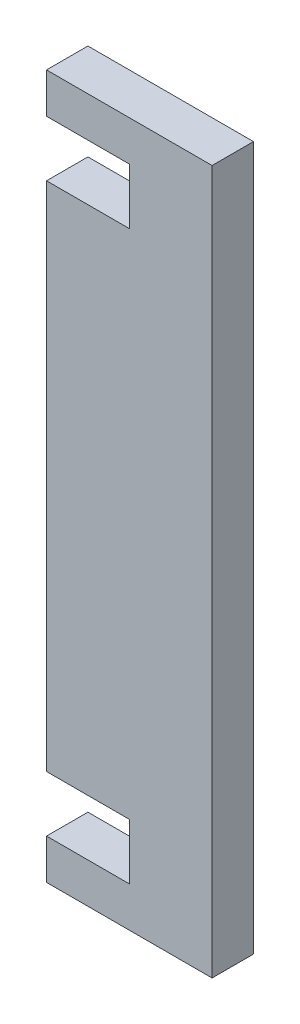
from build123d import *

# Parameters (mm, degrees)
ESQUISSE1_W             = 40
ESQUISSE1_H             = 170
BOSS_EXTRU_1_DEPTH      = 10
ESQUISSE2_W             = 20
ESQUISSE2_H             = 13.5
ENL_V_MAT_EXTRU_1_DEPTH = 10


with BuildPart() as part:
    # Esquisse1 → Boss.-Extru.1 (new body)
    with BuildSketch(Plane.XY):
        with Locations((20, 85)):
            Rectangle(ESQUISSE1_W, ESQUISSE1_H)
    extrude(amount=BOSS_EXTRU_1_DEPTH)

    # Esquisse2 → Enl_v. mat.-Extru.1 (cut)
    with BuildSketch(Plane.XY.offset(10)):
        with Locations((10, 16.45)):
            Rectangle(ESQUISSE2_W, ESQUISSE2_H)
        with Locations((10, 153.55)):
            Rectangle(ESQUISSE2_W, ESQUISSE2_H)
    extrude(amount=-ENL_V_MAT_EXTRU_1_DEPTH, mode=Mode.SUBTRACT)


solid = part.part
